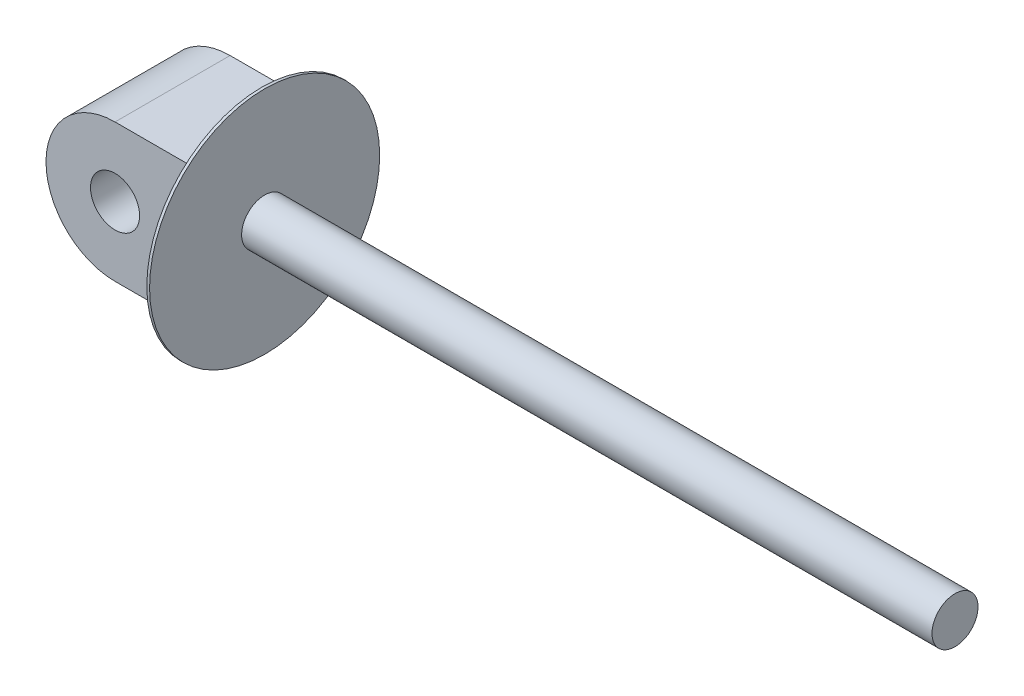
ISO-10303-21;
HEADER;
FILE_DESCRIPTION(('STEP AP214'),'2;1');
FILE_NAME('part.step','',(''),(''),'','','');
FILE_SCHEMA(('AUTOMOTIVE_DESIGN { 1 0 10303 214 1 1 1 1 }'));
ENDSEC;
DATA;
#1=APPLICATION_CONTEXT('core data for automotive mechanical design processes');
#2=APPLICATION_PROTOCOL_DEFINITION('international standard','automotive_design',2000,#1);
#3=PRODUCT_CONTEXT('',#1,'mechanical');
#4=PRODUCT('Part','Part','',(#3));
#5=PRODUCT_RELATED_PRODUCT_CATEGORY('part','',(#4));
#6=PRODUCT_DEFINITION_FORMATION('','',#4);
#7=PRODUCT_DEFINITION_CONTEXT('part definition',#1,'design');
#8=PRODUCT_DEFINITION('design','',#6,#7);
#9=PRODUCT_DEFINITION_SHAPE('','',#8);
#10=(LENGTH_UNIT() NAMED_UNIT(*) SI_UNIT(.MILLI.,.METRE.));
#11=(NAMED_UNIT(*) PLANE_ANGLE_UNIT() SI_UNIT($,.RADIAN.));
#12=(NAMED_UNIT(*) SI_UNIT($,.STERADIAN.) SOLID_ANGLE_UNIT());
#13=UNCERTAINTY_MEASURE_WITH_UNIT(LENGTH_MEASURE(1.E-05),#10,'distance_accuracy_value','');
#14=(GEOMETRIC_REPRESENTATION_CONTEXT(3) GLOBAL_UNCERTAINTY_ASSIGNED_CONTEXT((#13)) GLOBAL_UNIT_ASSIGNED_CONTEXT((#10,
#11,#12)) REPRESENTATION_CONTEXT('',''));
#15=CARTESIAN_POINT('',(0.,0.,0.));
#16=DIRECTION('',(0.,0.,1.));
#17=DIRECTION('',(1.,0.,0.));
#18=AXIS2_PLACEMENT_3D('',#15,#16,#17);
#19=CARTESIAN_POINT('',(0.,0.,3.75));
#20=DIRECTION('',(0.,0.,1.));
#21=DIRECTION('',(1.,0.,0.));
#22=AXIS2_PLACEMENT_3D('',#19,#20,#21);
#23=PLANE('',#22);
#24=CARTESIAN_POINT('',(0.,0.,3.75));
#25=DIRECTION('',(0.,0.,1.));
#26=DIRECTION('',(1.,0.,0.));
#27=AXIS2_PLACEMENT_3D('',#24,#25,#26);
#28=CIRCLE('',#27,4.5);
#29=CARTESIAN_POINT('',(0.,4.5,3.75));
#30=VERTEX_POINT('',#29);
#31=CARTESIAN_POINT('',(0.,-4.5,3.75));
#32=VERTEX_POINT('',#31);
#33=EDGE_CURVE('E101',#30,#32,#28,.T.);
#34=ORIENTED_EDGE('',*,*,#33,.T.);
#35=DIRECTION('',(1.,0.,0.));
#36=VECTOR('',#35,1.);
#37=CARTESIAN_POINT('',(4.,-4.5,3.75));
#38=LINE('',#37,#36);
#39=CARTESIAN_POINT('',(5.22209821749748,-4.5,3.75));
#40=VERTEX_POINT('',#39);
#41=EDGE_CURVE('E73',#32,#40,#38,.T.);
#42=ORIENTED_EDGE('',*,*,#41,.T.);
#43=CARTESIAN_POINT('',(5.22209821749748,-4.5,3.75));
#44=CARTESIAN_POINT('',(5.1935805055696,-4.39800167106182,3.75));
#45=CARTESIAN_POINT('',(5.16542737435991,-4.29590145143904,3.75));
#46=CARTESIAN_POINT('',(5.10996075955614,-4.09146980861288,3.75));
#47=CARTESIAN_POINT('',(5.0826473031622,-3.98913837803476,3.75));
#48=CARTESIAN_POINT('',(5.00211127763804,-3.68167576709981,3.75));
#49=CARTESIAN_POINT('',(4.95031837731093,-3.47616610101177,3.75));
#50=CARTESIAN_POINT('',(4.85133230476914,-3.06236533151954,3.75));
#51=CARTESIAN_POINT('',(4.80417745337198,-2.8540649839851,3.75));
#52=CARTESIAN_POINT('',(4.71648829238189,-2.43607570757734,3.75));
#53=CARTESIAN_POINT('',(4.6759533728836,-2.22638690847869,3.75));
#54=CARTESIAN_POINT('',(4.6045472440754,-1.81203554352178,3.75));
#55=CARTESIAN_POINT('',(4.57341542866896,-1.60741865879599,3.75));
#56=CARTESIAN_POINT('',(4.52109214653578,-1.19690095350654,3.75));
#57=CARTESIAN_POINT('',(4.49990002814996,-0.991000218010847,3.75));
#58=CARTESIAN_POINT('',(4.46920015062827,-0.579078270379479,3.75));
#59=CARTESIAN_POINT('',(4.45964908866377,-0.373060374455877,3.75));
#60=CARTESIAN_POINT('',(4.45298016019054,0.0391756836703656,3.75));
#61=CARTESIAN_POINT('',(4.45586162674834,0.245393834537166,3.75));
#62=CARTESIAN_POINT('',(4.47217727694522,0.620769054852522,3.75));
#63=CARTESIAN_POINT('',(4.48365046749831,0.790016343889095,3.75));
#64=CARTESIAN_POINT('',(4.51411227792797,1.12784696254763,3.75));
#65=CARTESIAN_POINT('',(4.53310190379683,1.29643020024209,3.75));
#66=CARTESIAN_POINT('',(4.57769176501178,1.63320807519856,3.75));
#67=CARTESIAN_POINT('',(4.60331118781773,1.80140013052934,3.75));
#68=CARTESIAN_POINT('',(4.66006885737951,2.13683211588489,3.75));
#69=CARTESIAN_POINT('',(4.69120688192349,2.30407208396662,3.75));
#70=CARTESIAN_POINT('',(4.75890042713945,2.64211167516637,3.75));
#71=CARTESIAN_POINT('',(4.79557885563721,2.81288645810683,3.75));
#72=CARTESIAN_POINT('',(4.87277557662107,3.15356753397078,3.75));
#73=CARTESIAN_POINT('',(4.91329404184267,3.32347378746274,3.75));
#74=CARTESIAN_POINT('',(4.99715659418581,3.66153593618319,3.75));
#75=CARTESIAN_POINT('',(5.04048292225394,3.82969626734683,3.75));
#76=CARTESIAN_POINT('',(5.12959033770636,4.16532887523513,3.75));
#77=CARTESIAN_POINT('',(5.17537090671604,4.33280128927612,3.75));
#78=CARTESIAN_POINT('',(5.22209821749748,4.5,3.75));
#79=B_SPLINE_CURVE_WITH_KNOTS('',3,(#43,#44,#45,#46,#47,#48,#49,#50,#51,#52,#53,#54,#55,#56,#57,
#58,#59,#60,#61,#62,#63,#64,#65,#66,#67,#68,#69,#70,#71,#72,#73,#74,#75,#76,#77,#78),
.UNSPECIFIED.,.F.,.F.,(4,2,2,2,2,2,2,2,2,2,2,2,2,2,2,2,2,4),(0.,0.317728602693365,
0.63546748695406,1.27122522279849,1.91185851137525,2.55243274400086,3.17315050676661,
3.79382756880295,4.41218869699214,5.03051665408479,5.53924623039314,6.0480439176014,
6.55833092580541,7.0685973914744,7.59255036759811,8.11652692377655,8.63746323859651,
9.1582899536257),.UNSPECIFIED.);
#80=CARTESIAN_POINT('',(5.22209821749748,4.5,3.75));
#81=VERTEX_POINT('',#80);
#82=EDGE_CURVE('E149',#40,#81,#79,.T.);
#83=ORIENTED_EDGE('',*,*,#82,.T.);
#84=DIRECTION('',(-1.,0.,0.));
#85=VECTOR('',#84,1.);
#86=CARTESIAN_POINT('',(0.,4.5,3.75));
#87=LINE('',#86,#85);
#88=EDGE_CURVE('E66',#81,#30,#87,.T.);
#89=ORIENTED_EDGE('',*,*,#88,.T.);
#90=EDGE_LOOP('',(#34,#42,#83,#89));
#91=FACE_BOUND('',#90,.T.);
#92=CARTESIAN_POINT('',(0.,0.,3.75));
#93=DIRECTION('',(0.,0.,1.));
#94=DIRECTION('',(1.,0.,0.));
#95=AXIS2_PLACEMENT_3D('',#92,#93,#94);
#96=CIRCLE('',#95,1.6);
#97=CARTESIAN_POINT('',(1.6,0.,3.75));
#98=VERTEX_POINT('',#97);
#99=EDGE_CURVE('E186',#98,#98,#96,.T.);
#100=ORIENTED_EDGE('',*,*,#99,.F.);
#101=EDGE_LOOP('',(#100));
#102=FACE_BOUND('',#101,.T.);
#103=ADVANCED_FACE('F43',(#91,#102),#23,.T.);
#104=CARTESIAN_POINT('',(0.,0.,-3.75));
#105=DIRECTION('',(0.,0.,1.));
#106=DIRECTION('',(1.,0.,0.));
#107=AXIS2_PLACEMENT_3D('',#104,#105,#106);
#108=PLANE('',#107);
#109=CARTESIAN_POINT('',(0.,0.,-3.75));
#110=DIRECTION('',(0.,0.,1.));
#111=DIRECTION('',(1.,0.,0.));
#112=AXIS2_PLACEMENT_3D('',#109,#110,#111);
#113=CIRCLE('',#112,4.5);
#114=CARTESIAN_POINT('',(0.,4.5,-3.75));
#115=VERTEX_POINT('',#114);
#116=CARTESIAN_POINT('',(0.,-4.5,-3.75));
#117=VERTEX_POINT('',#116);
#118=EDGE_CURVE('E111',#115,#117,#113,.T.);
#119=ORIENTED_EDGE('',*,*,#118,.F.);
#120=DIRECTION('',(-1.,0.,0.));
#121=VECTOR('',#120,1.);
#122=CARTESIAN_POINT('',(0.,4.5,-3.75));
#123=LINE('',#122,#121);
#124=CARTESIAN_POINT('',(5.22209821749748,4.5,-3.75));
#125=VERTEX_POINT('',#124);
#126=EDGE_CURVE('E107',#125,#115,#123,.T.);
#127=ORIENTED_EDGE('',*,*,#126,.F.);
#128=CARTESIAN_POINT('',(5.22209821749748,4.5,-3.75));
#129=CARTESIAN_POINT('',(5.1935805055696,4.39800167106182,-3.75));
#130=CARTESIAN_POINT('',(5.16542737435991,4.29590145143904,-3.75));
#131=CARTESIAN_POINT('',(5.10996075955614,4.09146980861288,-3.75));
#132=CARTESIAN_POINT('',(5.08264730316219,3.98913837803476,-3.75));
#133=CARTESIAN_POINT('',(5.00211127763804,3.68167576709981,-3.75));
#134=CARTESIAN_POINT('',(4.95031837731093,3.47616610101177,-3.75));
#135=CARTESIAN_POINT('',(4.85133230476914,3.06236533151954,-3.75));
#136=CARTESIAN_POINT('',(4.80417745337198,2.8540649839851,-3.75));
#137=CARTESIAN_POINT('',(4.71648829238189,2.43607570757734,-3.75));
#138=CARTESIAN_POINT('',(4.6759533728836,2.22638690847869,-3.75));
#139=CARTESIAN_POINT('',(4.6045472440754,1.81203554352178,-3.75));
#140=CARTESIAN_POINT('',(4.57341542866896,1.60741865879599,-3.75));
#141=CARTESIAN_POINT('',(4.52109214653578,1.19690095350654,-3.75));
#142=CARTESIAN_POINT('',(4.49990002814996,0.991000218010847,-3.75));
#143=CARTESIAN_POINT('',(4.46920015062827,0.579078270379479,-3.75));
#144=CARTESIAN_POINT('',(4.45964908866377,0.373060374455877,-3.75));
#145=CARTESIAN_POINT('',(4.45298016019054,-0.0391756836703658,-3.75));
#146=CARTESIAN_POINT('',(4.45586162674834,-0.245393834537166,-3.75));
#147=CARTESIAN_POINT('',(4.47217727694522,-0.620769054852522,-3.75));
#148=CARTESIAN_POINT('',(4.48365046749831,-0.790016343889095,-3.75));
#149=CARTESIAN_POINT('',(4.51411227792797,-1.12784696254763,-3.75));
#150=CARTESIAN_POINT('',(4.53310190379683,-1.29643020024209,-3.75));
#151=CARTESIAN_POINT('',(4.57769176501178,-1.63320807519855,-3.75));
#152=CARTESIAN_POINT('',(4.60331118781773,-1.80140013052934,-3.75));
#153=CARTESIAN_POINT('',(4.66006885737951,-2.13683211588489,-3.75));
#154=CARTESIAN_POINT('',(4.69120688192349,-2.30407208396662,-3.75));
#155=CARTESIAN_POINT('',(4.75890042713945,-2.64211167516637,-3.75));
#156=CARTESIAN_POINT('',(4.79557885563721,-2.81288645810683,-3.75));
#157=CARTESIAN_POINT('',(4.87277557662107,-3.15356753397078,-3.75));
#158=CARTESIAN_POINT('',(4.91329404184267,-3.32347378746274,-3.75));
#159=CARTESIAN_POINT('',(4.99715659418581,-3.66153593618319,-3.75));
#160=CARTESIAN_POINT('',(5.04048292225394,-3.82969626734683,-3.75));
#161=CARTESIAN_POINT('',(5.12959033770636,-4.16532887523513,-3.75));
#162=CARTESIAN_POINT('',(5.17537090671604,-4.33280128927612,-3.75));
#163=CARTESIAN_POINT('',(5.22209821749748,-4.5,-3.75));
#164=B_SPLINE_CURVE_WITH_KNOTS('',3,(#128,#129,#130,#131,#132,#133,#134,#135,#136,#137,#138,
#139,#140,#141,#142,#143,#144,#145,#146,#147,#148,#149,#150,#151,#152,#153,#154,#155,#156,#157,
#158,#159,#160,#161,#162,#163),.UNSPECIFIED.,.F.,.F.,(4,2,2,2,2,2,2,2,2,2,2,2,2,2,2,2,2,4),(0.,
0.317728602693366,0.635467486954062,1.27122522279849,1.91185851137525,2.55243274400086,
3.17315050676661,3.79382756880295,4.41218869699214,5.03051665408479,5.53924623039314,
6.0480439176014,6.55833092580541,7.0685973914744,7.59255036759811,8.11652692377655,
8.63746323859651,9.1582899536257),.UNSPECIFIED.);
#165=CARTESIAN_POINT('',(5.22209821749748,-4.5,-3.75));
#166=VERTEX_POINT('',#165);
#167=EDGE_CURVE('E127',#125,#166,#164,.T.);
#168=ORIENTED_EDGE('',*,*,#167,.T.);
#169=DIRECTION('',(1.,0.,0.));
#170=VECTOR('',#169,1.);
#171=CARTESIAN_POINT('',(4.,-4.5,-3.75));
#172=LINE('',#171,#170);
#173=EDGE_CURVE('E193',#117,#166,#172,.T.);
#174=ORIENTED_EDGE('',*,*,#173,.F.);
#175=EDGE_LOOP('',(#119,#127,#168,#174));
#176=FACE_BOUND('',#175,.T.);
#177=CARTESIAN_POINT('',(0.,0.,-3.75));
#178=DIRECTION('',(0.,0.,1.));
#179=DIRECTION('',(1.,0.,0.));
#180=AXIS2_PLACEMENT_3D('',#177,#178,#179);
#181=CIRCLE('',#180,1.6);
#182=CARTESIAN_POINT('',(1.6,0.,-3.75));
#183=VERTEX_POINT('',#182);
#184=EDGE_CURVE('E183',#183,#183,#181,.T.);
#185=ORIENTED_EDGE('',*,*,#184,.T.);
#186=EDGE_LOOP('',(#185));
#187=FACE_BOUND('',#186,.T.);
#188=ADVANCED_FACE('F139',(#176,#187),#108,.F.);
#189=CARTESIAN_POINT('',(0.,0.,3.75));
#190=DIRECTION('',(0.,0.,-1.));
#191=DIRECTION('',(-1.,0.,0.));
#192=AXIS2_PLACEMENT_3D('',#189,#190,#191);
#193=CYLINDRICAL_SURFACE('',#192,4.5);
#194=ORIENTED_EDGE('',*,*,#118,.T.);
#195=DIRECTION('',(0.,0.,-1.));
#196=VECTOR('',#195,1.);
#197=CARTESIAN_POINT('',(0.,-4.5,3.75));
#198=LINE('',#197,#196);
#199=EDGE_CURVE('E96',#32,#117,#198,.T.);
#200=ORIENTED_EDGE('',*,*,#199,.F.);
#201=ORIENTED_EDGE('',*,*,#33,.F.);
#202=DIRECTION('',(0.,0.,-1.));
#203=VECTOR('',#202,1.);
#204=CARTESIAN_POINT('',(0.,4.5,3.75));
#205=LINE('',#204,#203);
#206=EDGE_CURVE('E113',#30,#115,#205,.T.);
#207=ORIENTED_EDGE('',*,*,#206,.T.);
#208=EDGE_LOOP('',(#194,#200,#201,#207));
#209=FACE_BOUND('',#208,.T.);
#210=ADVANCED_FACE('F109',(#209),#193,.T.);
#211=CARTESIAN_POINT('',(4.,-4.5,3.75));
#212=DIRECTION('',(0.,1.,0.));
#213=DIRECTION('',(0.,0.,1.));
#214=AXIS2_PLACEMENT_3D('',#211,#212,#213);
#215=PLANE('',#214);
#216=ORIENTED_EDGE('',*,*,#173,.T.);
#217=CARTESIAN_POINT('',(5.22209821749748,-4.5,-3.75));
#218=CARTESIAN_POINT('',(5.1929162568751,-4.5,-3.62474284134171));
#219=CARTESIAN_POINT('',(5.16454501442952,-4.5,-3.49929686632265));
#220=CARTESIAN_POINT('',(5.10967504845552,-4.5,-3.24798323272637));
#221=CARTESIAN_POINT('',(5.08317651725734,-4.5,-3.12211553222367));
#222=CARTESIAN_POINT('',(5.0068158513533,-4.5,-2.74355683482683));
#223=CARTESIAN_POINT('',(4.96015824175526,-4.5,-2.49020368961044));
#224=CARTESIAN_POINT('',(4.87783759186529,-4.5,-1.98187931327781));
#225=CARTESIAN_POINT('',(4.84216637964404,-4.5,-1.72690942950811));
#226=CARTESIAN_POINT('',(4.78433807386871,-4.5,-1.21551736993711));
#227=CARTESIAN_POINT('',(4.76217474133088,-4.5,-0.959095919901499));
#228=CARTESIAN_POINT('',(4.7336713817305,-4.5,-0.451065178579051));
#229=CARTESIAN_POINT('',(4.72699075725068,-4.5,-0.199475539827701));
#230=CARTESIAN_POINT('',(4.72910969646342,-4.5,0.303669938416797));
#231=CARTESIAN_POINT('',(4.73791125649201,-4.5,0.555225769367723));
#232=CARTESIAN_POINT('',(4.77012049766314,-4.5,1.05711023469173));
#233=CARTESIAN_POINT('',(4.79351317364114,-4.5,1.3074398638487));
#234=CARTESIAN_POINT('',(4.85290930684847,-4.5,1.80659543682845));
#235=CARTESIAN_POINT('',(4.88891416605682,-4.5,2.05542121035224));
#236=CARTESIAN_POINT('',(4.95010031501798,-4.5,2.42437224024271));
#237=CARTESIAN_POINT('',(4.97138515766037,-4.5,2.54516563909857));
#238=CARTESIAN_POINT('',(5.01612249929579,-4.5,2.78632856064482));
#239=CARTESIAN_POINT('',(5.03957458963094,-4.5,2.90669815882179));
#240=CARTESIAN_POINT('',(5.08854596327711,-4.5,3.14777212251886));
#241=CARTESIAN_POINT('',(5.11407689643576,-4.5,3.26847410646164));
#242=CARTESIAN_POINT('',(5.16685631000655,-4.5,3.50950962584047));
#243=CARTESIAN_POINT('',(5.1941048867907,-4.5,3.62984314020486));
#244=CARTESIAN_POINT('',(5.22209821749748,-4.5,3.75));
#245=B_SPLINE_CURVE_WITH_KNOTS('',3,(#217,#218,#219,#220,#221,#222,#223,#224,#225,#226,#227,
#228,#229,#230,#231,#232,#233,#234,#235,#236,#237,#238,#239,#240,#241,#242,#243,#244),
.UNSPECIFIED.,.F.,.F.,(4,2,2,2,2,2,2,2,2,2,2,2,2,4),(0.,0.385829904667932,0.771699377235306,
1.54434268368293,2.31640988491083,3.08812021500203,3.84268593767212,4.59734896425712,
5.3512371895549,6.10520924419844,6.473157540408,6.84103659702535,7.21114167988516,
7.58126754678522),.UNSPECIFIED.);
#246=EDGE_CURVE('E99',#166,#40,#245,.T.);
#247=ORIENTED_EDGE('',*,*,#246,.T.);
#248=ORIENTED_EDGE('',*,*,#41,.F.);
#249=ORIENTED_EDGE('',*,*,#199,.T.);
#250=EDGE_LOOP('',(#216,#247,#248,#249));
#251=FACE_BOUND('',#250,.T.);
#252=ADVANCED_FACE('F94',(#251),#215,.F.);
#253=CARTESIAN_POINT('',(0.,4.5,3.75));
#254=DIRECTION('',(0.,-1.,0.));
#255=DIRECTION('',(0.,0.,-1.));
#256=AXIS2_PLACEMENT_3D('',#253,#254,#255);
#257=PLANE('',#256);
#258=ORIENTED_EDGE('',*,*,#126,.T.);
#259=ORIENTED_EDGE('',*,*,#206,.F.);
#260=ORIENTED_EDGE('',*,*,#88,.F.);
#261=CARTESIAN_POINT('',(5.22209821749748,4.5,3.75));
#262=CARTESIAN_POINT('',(5.18623482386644,4.5,3.59603790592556));
#263=CARTESIAN_POINT('',(5.15158532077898,4.5,3.44178288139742));
#264=CARTESIAN_POINT('',(5.08520277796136,4.5,3.13261617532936));
#265=CARTESIAN_POINT('',(5.05347031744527,4.5,2.97770436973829));
#266=CARTESIAN_POINT('',(4.99352737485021,4.5,2.66774290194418));
#267=CARTESIAN_POINT('',(4.96530526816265,4.5,2.51269550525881));
#268=CARTESIAN_POINT('',(4.91281930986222,4.5,2.20193395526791));
#269=CARTESIAN_POINT('',(4.88855530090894,4.5,2.04621982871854));
#270=CARTESIAN_POINT('',(4.84453773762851,4.5,1.73392542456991));
#271=CARTESIAN_POINT('',(4.82479059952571,4.5,1.57734423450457));
#272=CARTESIAN_POINT('',(4.79041778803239,4.5,1.26362357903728));
#273=CARTESIAN_POINT('',(4.77579184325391,4.5,1.10648414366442));
#274=CARTESIAN_POINT('',(4.7521199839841,4.5,0.791257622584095));
#275=CARTESIAN_POINT('',(4.74309266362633,4.5,0.633169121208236));
#276=CARTESIAN_POINT('',(4.7309826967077,4.5,0.316723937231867));
#277=CARTESIAN_POINT('',(4.72790164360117,4.5,0.158367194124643));
#278=CARTESIAN_POINT('',(4.72794046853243,4.5,0.));
#279=B_SPLINE_CURVE_WITH_KNOTS('',3,(#261,#262,#263,#264,#265,#266,#267,#268,#269,#270,#271,
#272,#273,#274,#275,#276,#277,#278),.UNSPECIFIED.,.F.,.F.,(4,2,2,2,2,2,2,2,4),(0.,
0.474261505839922,0.948616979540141,1.42135724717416,1.89407871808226,2.36746757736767,
2.84083134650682,3.31575894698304,3.79081379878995),.UNSPECIFIED.);
#280=CARTESIAN_POINT('',(4.72794046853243,4.5,0.));
#281=VERTEX_POINT('',#280);
#282=EDGE_CURVE('E49',#81,#281,#279,.T.);
#283=ORIENTED_EDGE('',*,*,#282,.T.);
#284=CARTESIAN_POINT('',(4.72794046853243,4.5,0.));
#285=CARTESIAN_POINT('',(4.72790164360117,4.5,-0.158367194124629));
#286=CARTESIAN_POINT('',(4.7309826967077,4.5,-0.316723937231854));
#287=CARTESIAN_POINT('',(4.74309266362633,4.5,-0.633169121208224));
#288=CARTESIAN_POINT('',(4.7521199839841,4.5,-0.791257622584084));
#289=CARTESIAN_POINT('',(4.77579184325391,4.5,-1.10648414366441));
#290=CARTESIAN_POINT('',(4.79041778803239,4.5,-1.26362357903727));
#291=CARTESIAN_POINT('',(4.82479059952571,4.5,-1.57734423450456));
#292=CARTESIAN_POINT('',(4.84453773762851,4.5,-1.7339254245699));
#293=CARTESIAN_POINT('',(4.88855530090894,4.5,-2.04621982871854));
#294=CARTESIAN_POINT('',(4.91281930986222,4.5,-2.2019339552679));
#295=CARTESIAN_POINT('',(4.96530526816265,4.5,-2.51269550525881));
#296=CARTESIAN_POINT('',(4.99352737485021,4.5,-2.66774290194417));
#297=CARTESIAN_POINT('',(5.05347031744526,4.5,-2.97770436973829));
#298=CARTESIAN_POINT('',(5.08520277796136,4.5,-3.13261617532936));
#299=CARTESIAN_POINT('',(5.15158532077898,4.5,-3.44178288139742));
#300=CARTESIAN_POINT('',(5.18623482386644,4.5,-3.59603790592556));
#301=CARTESIAN_POINT('',(5.22209821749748,4.5,-3.75));
#302=B_SPLINE_CURVE_WITH_KNOTS('',3,(#284,#285,#286,#287,#288,#289,#290,#291,#292,#293,#294,
#295,#296,#297,#298,#299,#300,#301),.UNSPECIFIED.,.F.,.F.,(4,2,2,2,2,2,2,2,4),(0.,
0.475054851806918,0.949982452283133,1.42334622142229,1.8967350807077,2.36945655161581,
2.84219681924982,3.31655229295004,3.79081379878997),.UNSPECIFIED.);
#303=EDGE_CURVE('E116',#281,#125,#302,.T.);
#304=ORIENTED_EDGE('',*,*,#303,.T.);
#305=EDGE_LOOP('',(#258,#259,#260,#283,#304));
#306=FACE_BOUND('',#305,.T.);
#307=ADVANCED_FACE('F134',(#306),#257,.F.);
#308=CARTESIAN_POINT('',(0.,0.,3.75));
#309=DIRECTION('',(0.,0.,-1.));
#310=DIRECTION('',(-1.,0.,0.));
#311=AXIS2_PLACEMENT_3D('',#308,#309,#310);
#312=CYLINDRICAL_SURFACE('',#311,1.6);
#313=ORIENTED_EDGE('',*,*,#99,.T.);
#314=EDGE_LOOP('',(#313));
#315=FACE_BOUND('',#314,.T.);
#316=ORIENTED_EDGE('',*,*,#184,.F.);
#317=EDGE_LOOP('',(#316));
#318=FACE_BOUND('',#317,.T.);
#319=ADVANCED_FACE('F138',(#315,#318),#312,.F.);
#320=CARTESIAN_POINT('',(6.,0.,0.));
#321=DIRECTION('',(-1.,0.,0.));
#322=DIRECTION('',(0.,-1.,0.));
#323=AXIS2_PLACEMENT_3D('',#320,#321,#322);
#324=CYLINDRICAL_SURFACE('',#323,7.5);
#325=CARTESIAN_POINT('',(5.81985117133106,0.,0.));
#326=DIRECTION('',(1.,0.,0.));
#327=DIRECTION('',(0.,1.,0.));
#328=AXIS2_PLACEMENT_3D('',#325,#326,#327);
#329=CIRCLE('',#328,7.5);
#330=CARTESIAN_POINT('',(5.81985117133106,7.5,0.));
#331=VERTEX_POINT('',#330);
#332=EDGE_CURVE('E112',#331,#331,#329,.T.);
#333=ORIENTED_EDGE('',*,*,#332,.T.);
#334=EDGE_LOOP('',(#333));
#335=FACE_BOUND('',#334,.T.);
#336=CARTESIAN_POINT('',(6.,0.,0.));
#337=DIRECTION('',(1.,0.,0.));
#338=DIRECTION('',(0.,1.,0.));
#339=AXIS2_PLACEMENT_3D('',#336,#337,#338);
#340=CIRCLE('',#339,7.5);
#341=CARTESIAN_POINT('',(6.,7.5,0.));
#342=VERTEX_POINT('',#341);
#343=EDGE_CURVE('E180',#342,#342,#340,.T.);
#344=ORIENTED_EDGE('',*,*,#343,.F.);
#345=EDGE_LOOP('',(#344));
#346=FACE_BOUND('',#345,.T.);
#347=ADVANCED_FACE('F159',(#335,#346),#324,.T.);
#348=CARTESIAN_POINT('',(6.,0.,0.));
#349=DIRECTION('',(1.,0.,0.));
#350=DIRECTION('',(0.,1.,0.));
#351=AXIS2_PLACEMENT_3D('',#348,#349,#350);
#352=PLANE('',#351);
#353=CARTESIAN_POINT('',(6.,0.,0.));
#354=DIRECTION('',(1.,0.,0.));
#355=DIRECTION('',(0.,1.,0.));
#356=AXIS2_PLACEMENT_3D('',#353,#354,#355);
#357=CIRCLE('',#356,1.5);
#358=CARTESIAN_POINT('',(6.00000000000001,-1.5,0.));
#359=VERTEX_POINT('',#358);
#360=EDGE_CURVE('E11',#359,#359,#357,.T.);
#361=ORIENTED_EDGE('',*,*,#360,.F.);
#362=EDGE_LOOP('',(#361));
#363=FACE_BOUND('',#362,.T.);
#364=ORIENTED_EDGE('',*,*,#343,.T.);
#365=EDGE_LOOP('',(#364));
#366=FACE_BOUND('',#365,.T.);
#367=ADVANCED_FACE('F163',(#363,#366),#352,.T.);
#368=CARTESIAN_POINT('',(5.81985117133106,0.,0.));
#369=DIRECTION('',(1.,0.,0.));
#370=DIRECTION('',(0.,1.,0.));
#371=AXIS2_PLACEMENT_3D('',#368,#369,#370);
#372=CONICAL_SURFACE('',#371,7.5,1.22173047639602);
#373=ORIENTED_EDGE('',*,*,#167,.F.);
#374=ORIENTED_EDGE('',*,*,#303,.F.);
#375=ORIENTED_EDGE('',*,*,#282,.F.);
#376=ORIENTED_EDGE('',*,*,#82,.F.);
#377=ORIENTED_EDGE('',*,*,#246,.F.);
#378=EDGE_LOOP('',(#373,#374,#375,#376,#377));
#379=FACE_BOUND('',#378,.T.);
#380=ORIENTED_EDGE('',*,*,#332,.F.);
#381=EDGE_LOOP('',(#380));
#382=FACE_BOUND('',#381,.T.);
#383=ADVANCED_FACE('F46',(#379,#382),#372,.T.);
#384=CARTESIAN_POINT('',(51.,0.,0.));
#385=DIRECTION('',(-1.,0.,0.));
#386=DIRECTION('',(0.,-1.,0.));
#387=AXIS2_PLACEMENT_3D('',#384,#385,#386);
#388=CYLINDRICAL_SURFACE('',#387,1.5);
#389=CARTESIAN_POINT('',(51.,0.,0.));
#390=DIRECTION('',(1.,0.,0.));
#391=DIRECTION('',(0.,1.,0.));
#392=AXIS2_PLACEMENT_3D('',#389,#390,#391);
#393=CIRCLE('',#392,1.5);
#394=CARTESIAN_POINT('',(51.,-1.5,0.));
#395=VERTEX_POINT('',#394);
#396=EDGE_CURVE('E179',#395,#395,#393,.T.);
#397=CARTESIAN_POINT('',(51.,-1.5,0.));
#398=CARTESIAN_POINT('',(50.53125,-1.5,0.));
#399=CARTESIAN_POINT('',(50.0625,-1.5,0.));
#400=CARTESIAN_POINT('',(49.125,-1.5,0.));
#401=CARTESIAN_POINT('',(48.65625,-1.5,0.));
#402=CARTESIAN_POINT('',(47.71875,-1.5,0.));
#403=CARTESIAN_POINT('',(47.25,-1.5,0.));
#404=CARTESIAN_POINT('',(46.3125,-1.5,0.));
#405=CARTESIAN_POINT('',(45.84375,-1.5,0.));
#406=CARTESIAN_POINT('',(44.90625,-1.5,0.));
#407=CARTESIAN_POINT('',(44.4375,-1.5,0.));
#408=CARTESIAN_POINT('',(43.5,-1.5,0.));
#409=CARTESIAN_POINT('',(43.03125,-1.5,0.));
#410=CARTESIAN_POINT('',(42.09375,-1.5,0.));
#411=CARTESIAN_POINT('',(41.625,-1.5,0.));
#412=CARTESIAN_POINT('',(40.6875,-1.5,0.));
#413=CARTESIAN_POINT('',(40.21875,-1.5,0.));
#414=CARTESIAN_POINT('',(39.28125,-1.5,0.));
#415=CARTESIAN_POINT('',(38.8125,-1.5,0.));
#416=CARTESIAN_POINT('',(37.875,-1.5,0.));
#417=CARTESIAN_POINT('',(37.40625,-1.5,0.));
#418=CARTESIAN_POINT('',(36.46875,-1.5,0.));
#419=CARTESIAN_POINT('',(36.,-1.5,0.));
#420=CARTESIAN_POINT('',(35.0625,-1.5,0.));
#421=CARTESIAN_POINT('',(34.59375,-1.5,0.));
#422=CARTESIAN_POINT('',(33.65625,-1.5,0.));
#423=CARTESIAN_POINT('',(33.1875,-1.5,0.));
#424=CARTESIAN_POINT('',(32.25,-1.5,0.));
#425=CARTESIAN_POINT('',(31.78125,-1.5,0.));
#426=CARTESIAN_POINT('',(30.84375,-1.5,0.));
#427=CARTESIAN_POINT('',(30.375,-1.5,0.));
#428=CARTESIAN_POINT('',(29.4375,-1.5,0.));
#429=CARTESIAN_POINT('',(28.96875,-1.5,0.));
#430=CARTESIAN_POINT('',(28.03125,-1.5,0.));
#431=CARTESIAN_POINT('',(27.5625,-1.5,0.));
#432=CARTESIAN_POINT('',(26.625,-1.5,0.));
#433=CARTESIAN_POINT('',(26.15625,-1.5,0.));
#434=CARTESIAN_POINT('',(25.21875,-1.5,0.));
#435=CARTESIAN_POINT('',(24.75,-1.5,0.));
#436=CARTESIAN_POINT('',(23.8125,-1.5,0.));
#437=CARTESIAN_POINT('',(23.34375,-1.5,0.));
#438=CARTESIAN_POINT('',(22.40625,-1.5,0.));
#439=CARTESIAN_POINT('',(21.9375,-1.5,0.));
#440=CARTESIAN_POINT('',(21.,-1.5,0.));
#441=CARTESIAN_POINT('',(20.53125,-1.5,0.));
#442=CARTESIAN_POINT('',(19.59375,-1.5,0.));
#443=CARTESIAN_POINT('',(19.125,-1.5,0.));
#444=CARTESIAN_POINT('',(18.1875,-1.5,0.));
#445=CARTESIAN_POINT('',(17.71875,-1.5,0.));
#446=CARTESIAN_POINT('',(16.78125,-1.5,0.));
#447=CARTESIAN_POINT('',(16.3125,-1.5,0.));
#448=CARTESIAN_POINT('',(15.375,-1.5,0.));
#449=CARTESIAN_POINT('',(14.90625,-1.5,0.));
#450=CARTESIAN_POINT('',(13.96875,-1.5,0.));
#451=CARTESIAN_POINT('',(13.5,-1.5,0.));
#452=CARTESIAN_POINT('',(12.5625,-1.5,0.));
#453=CARTESIAN_POINT('',(12.09375,-1.5,0.));
#454=CARTESIAN_POINT('',(11.15625,-1.5,0.));
#455=CARTESIAN_POINT('',(10.6875,-1.5,0.));
#456=CARTESIAN_POINT('',(9.75000000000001,-1.5,0.));
#457=CARTESIAN_POINT('',(9.28125000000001,-1.5,0.));
#458=CARTESIAN_POINT('',(8.34375000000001,-1.5,0.));
#459=CARTESIAN_POINT('',(7.87500000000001,-1.5,0.));
#460=CARTESIAN_POINT('',(6.9375,-1.5,0.));
#461=CARTESIAN_POINT('',(6.46875,-1.5,0.));
#462=CARTESIAN_POINT('',(6.00000000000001,-1.5,0.));
#463=B_SPLINE_CURVE_WITH_KNOTS('',3,(#397,#398,#399,#400,#401,#402,#403,#404,#405,#406,#407,
#408,#409,#410,#411,#412,#413,#414,#415,#416,#417,#418,#419,#420,#421,#422,#423,#424,#425,#426,
#427,#428,#429,#430,#431,#432,#433,#434,#435,#436,#437,#438,#439,#440,#441,#442,#443,#444,#445,
#446,#447,#448,#449,#450,#451,#452,#453,#454,#455,#456,#457,#458,#459,#460,#461,#462),
.UNSPECIFIED.,.F.,.F.,(4,2,2,2,2,2,2,2,2,2,2,2,2,2,2,2,2,2,2,2,2,2,2,2,2,2,2,2,2,2,2,2,4),(0.,
1.40625,2.8125,4.21875,5.62500000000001,7.03125,8.4375,9.84375000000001,11.25,12.65625,14.0625,
15.46875,16.875,18.28125,19.6875,21.09375,22.5,23.90625,25.3125,26.71875,28.125,29.53125,
30.9375,32.34375,33.75,35.15625,36.5625,37.96875,39.375,40.78125,42.1875,43.59375,45.),.UNSPECIFIED.);
#464=EDGE_CURVE('BSEAM168',#395,#359,#463,.T.);
#465=ORIENTED_EDGE('',*,*,#396,.F.);
#466=ORIENTED_EDGE('',*,*,#360,.T.);
#467=ORIENTED_EDGE('',*,*,#464,.T.);
#468=ORIENTED_EDGE('',*,*,#464,.F.);
#469=EDGE_LOOP('',(#465,#467,#466,#468));
#470=FACE_BOUND('',#469,.T.);
#471=ADVANCED_FACE('F168',(#470),#388,.T.);
#472=CARTESIAN_POINT('',(51.,0.,0.));
#473=DIRECTION('',(1.,0.,0.));
#474=DIRECTION('',(0.,1.,0.));
#475=AXIS2_PLACEMENT_3D('',#472,#473,#474);
#476=PLANE('',#475);
#477=ORIENTED_EDGE('',*,*,#396,.T.);
#478=EDGE_LOOP('',(#477));
#479=FACE_BOUND('',#478,.T.);
#480=ADVANCED_FACE('F171',(#479),#476,.T.);
#481=CLOSED_SHELL('',(#103,#188,#210,#252,#307,#319,#347,#367,#383,#471,#480));
#482=MANIFOLD_SOLID_BREP('B2',#481);
#483=ADVANCED_BREP_SHAPE_REPRESENTATION('',(#18,#482),#14);
#484=SHAPE_DEFINITION_REPRESENTATION(#9,#483);
ENDSEC;
END-ISO-10303-21;
